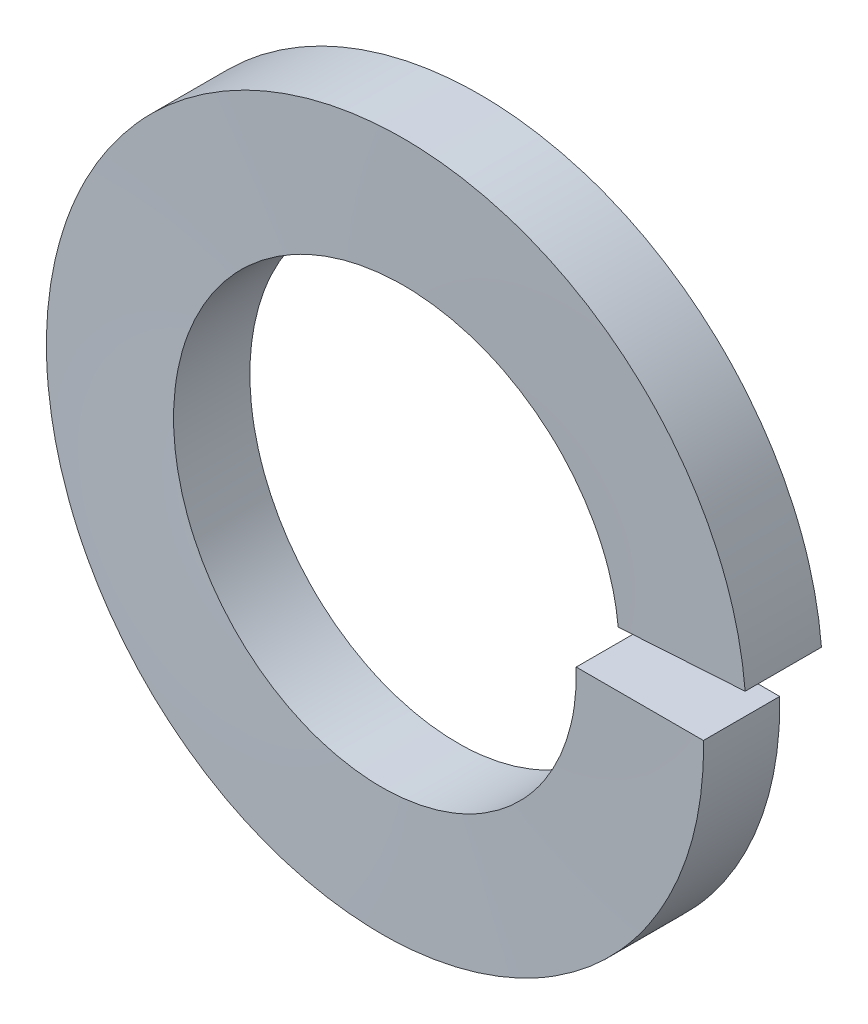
ISO-10303-21;
HEADER;
FILE_DESCRIPTION(('STEP AP214'),'2;1');
FILE_NAME('part.step','',(''),(''),'','','');
FILE_SCHEMA(('AUTOMOTIVE_DESIGN { 1 0 10303 214 1 1 1 1 }'));
ENDSEC;
DATA;
#1=APPLICATION_CONTEXT('core data for automotive mechanical design processes');
#2=APPLICATION_PROTOCOL_DEFINITION('international standard','automotive_design',2000,#1);
#3=PRODUCT_CONTEXT('',#1,'mechanical');
#4=PRODUCT('Part','Part','',(#3));
#5=PRODUCT_RELATED_PRODUCT_CATEGORY('part','',(#4));
#6=PRODUCT_DEFINITION_FORMATION('','',#4);
#7=PRODUCT_DEFINITION_CONTEXT('part definition',#1,'design');
#8=PRODUCT_DEFINITION('design','',#6,#7);
#9=PRODUCT_DEFINITION_SHAPE('','',#8);
#10=(LENGTH_UNIT() NAMED_UNIT(*) SI_UNIT(.MILLI.,.METRE.));
#11=(NAMED_UNIT(*) PLANE_ANGLE_UNIT() SI_UNIT($,.RADIAN.));
#12=(NAMED_UNIT(*) SI_UNIT($,.STERADIAN.) SOLID_ANGLE_UNIT());
#13=UNCERTAINTY_MEASURE_WITH_UNIT(LENGTH_MEASURE(1.E-05),#10,'distance_accuracy_value','');
#14=(GEOMETRIC_REPRESENTATION_CONTEXT(3) GLOBAL_UNCERTAINTY_ASSIGNED_CONTEXT((#13)) GLOBAL_UNIT_ASSIGNED_CONTEXT((#10,
#11,#12)) REPRESENTATION_CONTEXT('',''));
#15=CARTESIAN_POINT('',(0.,0.,0.));
#16=DIRECTION('',(0.,0.,1.));
#17=DIRECTION('',(1.,0.,0.));
#18=AXIS2_PLACEMENT_3D('',#15,#16,#17);
#19=CARTESIAN_POINT('',(4.953907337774,0.6195630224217,-1.78));
#20=CARTESIAN_POINT('',(5.03741687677,-0.04816326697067,-1.801666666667));
#21=CARTESIAN_POINT('',(4.930689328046,-1.417496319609,-1.845));
#22=CARTESIAN_POINT('',(3.975342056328,-3.243136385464,-1.91));
#23=CARTESIAN_POINT('',(2.37878708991,-4.545604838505,-1.975));
#24=CARTESIAN_POINT('',(0.3985506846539,-5.114914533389,-2.04));
#25=CARTESIAN_POINT('',(-1.645970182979,-4.859214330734,-2.105));
#26=CARTESIAN_POINT('',(-3.425005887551,-3.819753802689,-2.17));
#27=CARTESIAN_POINT('',(-4.651609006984,-2.164189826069,-2.235));
#28=CARTESIAN_POINT('',(-5.127935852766,-0.1595552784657,-2.300000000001));
#29=CARTESIAN_POINT('',(-4.777157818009,1.870814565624,-2.365000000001));
#30=CARTESIAN_POINT('',(-3.655853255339,3.599433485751,-2.430000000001));
#31=CARTESIAN_POINT('',(-1.944881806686,4.747485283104,-2.495000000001));
#32=CARTESIAN_POINT('',(0.07978734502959,5.129797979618,-2.560000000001));
#33=CARTESIAN_POINT('',(2.091586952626,4.684700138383,-2.625000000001));
#34=CARTESIAN_POINT('',(3.766027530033,3.484008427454,-2.69));
#35=CARTESIAN_POINT('',(4.833026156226,1.721293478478,-2.755));
#36=CARTESIAN_POINT('',(5.024678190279,0.361244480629,-2.798333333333));
#37=CARTESIAN_POINT('',(4.982842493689,-0.3103819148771,-2.82));
#38=CARTESIAN_POINT('',(5.951138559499,0.744282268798,-1.78));
#39=CARTESIAN_POINT('',(6.051458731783,-0.05785862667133,-1.801666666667));
#40=CARTESIAN_POINT('',(5.92324671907,-1.702841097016,-1.845));
#41=CARTESIAN_POINT('',(4.775586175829,-3.895986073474,-1.91));
#42=CARTESIAN_POINT('',(2.857641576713,-5.460643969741,-1.975));
#43=CARTESIAN_POINT('',(0.4787797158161,-6.144556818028,-2.04));
#44=CARTESIAN_POINT('',(-1.977307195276,-5.837383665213,-2.105));
#45=CARTESIAN_POINT('',(-4.11446626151,-4.58867770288,-2.17));
#46=CARTESIAN_POINT('',(-5.587986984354,-2.599845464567,-2.235));
#47=CARTESIAN_POINT('',(-6.160199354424,-0.191674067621,-2.300000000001));
#48=CARTESIAN_POINT('',(-5.738809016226,2.247413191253,-2.365000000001));
#49=CARTESIAN_POINT('',(-4.391783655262,4.324006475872,-2.430000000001));
#50=CARTESIAN_POINT('',(-2.336390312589,5.703163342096,-2.495000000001));
#51=CARTESIAN_POINT('',(0.09584869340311,6.162436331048,-2.560000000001));
#52=CARTESIAN_POINT('',(2.512627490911,5.627739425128,-2.625000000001));
#53=CARTESIAN_POINT('',(4.524136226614,4.185346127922,-2.69));
#54=CARTESIAN_POINT('',(5.805923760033,2.06779321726,-2.755));
#55=CARTESIAN_POINT('',(6.036155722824,0.4339637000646,-2.798333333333));
#56=CARTESIAN_POINT('',(5.985898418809,-0.3728624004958,-2.82));
#57=CARTESIAN_POINT('',(6.948369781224,0.8690015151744,-1.78));
#58=CARTESIAN_POINT('',(7.065500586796,-0.067553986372,-1.801666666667));
#59=CARTESIAN_POINT('',(6.915804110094,-1.988185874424,-1.845));
#60=CARTESIAN_POINT('',(5.57583029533,-4.548835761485,-1.91));
#61=CARTESIAN_POINT('',(3.336496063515,-6.375683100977,-1.975));
#62=CARTESIAN_POINT('',(0.5590087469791,-7.174199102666,-2.04));
#63=CARTESIAN_POINT('',(-2.308644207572,-6.815552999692,-2.105));
#64=CARTESIAN_POINT('',(-4.803926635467,-5.357601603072,-2.17));
#65=CARTESIAN_POINT('',(-6.524364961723,-3.035501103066,-2.235));
#66=CARTESIAN_POINT('',(-7.192462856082,-0.2237928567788,-2.300000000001));
#67=CARTESIAN_POINT('',(-6.700460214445,2.624011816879,-2.365000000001));
#68=CARTESIAN_POINT('',(-5.127714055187,5.048579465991,-2.430000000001));
#69=CARTESIAN_POINT('',(-2.727898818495,6.658841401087,-2.495000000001));
#70=CARTESIAN_POINT('',(0.1119100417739,7.195074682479,-2.560000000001));
#71=CARTESIAN_POINT('',(2.933668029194,6.570778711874,-2.625000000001));
#72=CARTESIAN_POINT('',(5.282244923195,4.886683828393,-2.69));
#73=CARTESIAN_POINT('',(6.77882136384,2.414292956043,-2.755));
#74=CARTESIAN_POINT('',(7.047633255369,0.5066829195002,-2.798333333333));
#75=CARTESIAN_POINT('',(6.988954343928,-0.4353428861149,-2.82));
#76=CARTESIAN_POINT('',(7.945601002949,0.9937207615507,-1.78));
#77=CARTESIAN_POINT('',(8.079542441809,-0.07724934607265,-1.801666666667));
#78=CARTESIAN_POINT('',(7.908361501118,-2.273530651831,-1.845));
#79=CARTESIAN_POINT('',(6.376074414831,-5.201685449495,-1.91));
#80=CARTESIAN_POINT('',(3.815350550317,-7.290722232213,-1.975));
#81=CARTESIAN_POINT('',(0.6392377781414,-8.203841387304,-2.04));
#82=CARTESIAN_POINT('',(-2.639981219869,-7.793722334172,-2.105));
#83=CARTESIAN_POINT('',(-5.493387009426,-6.126525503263,-2.17));
#84=CARTESIAN_POINT('',(-7.460742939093,-3.471156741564,-2.235));
#85=CARTESIAN_POINT('',(-8.224726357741,-0.2559116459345,-2.300000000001));
#86=CARTESIAN_POINT('',(-7.662111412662,3.000610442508,-2.365000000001));
#87=CARTESIAN_POINT('',(-5.86364445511,5.773152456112,-2.430000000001));
#88=CARTESIAN_POINT('',(-3.119407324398,7.614519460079,-2.495000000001));
#89=CARTESIAN_POINT('',(0.127971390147,8.227713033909,-2.560000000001));
#90=CARTESIAN_POINT('',(3.354708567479,7.51381799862,-2.625000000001));
#91=CARTESIAN_POINT('',(6.040353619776,5.588021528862,-2.69));
#92=CARTESIAN_POINT('',(7.751718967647,2.760792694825,-2.755));
#93=CARTESIAN_POINT('',(8.059110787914,0.5794021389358,-2.798333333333));
#94=CARTESIAN_POINT('',(7.992010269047,-0.4978233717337,-2.82));
#95=B_SPLINE_SURFACE_WITH_KNOTS('',3,3,((#19,#20,#21,#22,#23,#24,#25,#26,#27,#28,#29,#30,#31,
#32,#33,#34,#35,#36,#37),(#38,#39,#40,#41,#42,#43,#44,#45,#46,#47,#48,#49,#50,#51,#52,#53,#54,
#55,#56),(#57,#58,#59,#60,#61,#62,#63,#64,#65,#66,#67,#68,#69,#70,#71,#72,#73,#74,#75),(#76,#77,
#78,#79,#80,#81,#82,#83,#84,#85,#86,#87,#88,#89,#90,#91,#92,#93,#94)),.UNSPECIFIED.,.F.,.F.,.F.,
(4,4),(4,1,1,1,1,1,1,1,1,1,1,1,1,1,1,1,4),(-0.0025,1.0025),(-0.02,0.045,0.11,0.175,0.24,0.305,
0.37,0.435,0.5,0.565,0.63,0.695,0.76,0.825,0.89,0.955,1.02),.UNSPECIFIED.);
#96=CARTESIAN_POINT('',(4.99032798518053,0.310848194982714,-2.80000028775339));
#97=CARTESIAN_POINT('',(4.98218273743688,0.441794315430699,-2.79578266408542));
#98=CARTESIAN_POINT('',(4.96886134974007,0.572416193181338,-2.79156525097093));
#99=CARTESIAN_POINT('',(4.93200013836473,0.832198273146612,-2.78313064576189));
#100=CARTESIAN_POINT('',(4.90846123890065,0.961358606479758,-2.77891345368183));
#101=CARTESIAN_POINT('',(4.85130063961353,1.21741354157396,-2.77047881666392));
#102=CARTESIAN_POINT('',(4.81768010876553,1.34430840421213,-2.76626137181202));
#103=CARTESIAN_POINT('',(4.74056638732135,1.59506634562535,-2.75782576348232));
#104=CARTESIAN_POINT('',(4.69707271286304,1.71892927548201,-2.75360759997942));
#105=CARTESIAN_POINT('',(4.59700208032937,1.97163471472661,-2.74486819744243));
#106=CARTESIAN_POINT('',(4.53970894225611,2.10019429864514,-2.74034698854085));
#107=CARTESIAN_POINT('',(4.41446862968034,2.35207523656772,-2.73130376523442));
#108=CARTESIAN_POINT('',(4.34651726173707,2.47539450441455,-2.72678175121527));
#109=CARTESIAN_POINT('',(4.20049315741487,2.7158108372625,-2.71773979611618));
#110=CARTESIAN_POINT('',(4.12242506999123,2.83291072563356,-2.71321985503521));
#111=CARTESIAN_POINT('',(3.95666822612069,3.06015736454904,-2.70417745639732));
#112=CARTESIAN_POINT('',(3.86897591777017,3.17030152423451,-2.69965499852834));
#113=CARTESIAN_POINT('',(3.68465457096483,3.38276389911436,-2.69061123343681));
#114=CARTESIAN_POINT('',(3.58802904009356,3.48508515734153,-2.68608992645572));
#115=CARTESIAN_POINT('',(3.38646220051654,3.68125783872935,-2.67704646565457));
#116=CARTESIAN_POINT('',(3.28151783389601,3.77510611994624,-2.67252431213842));
#117=CARTESIAN_POINT('',(3.06411875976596,3.95359986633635,-2.66348180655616));
#118=CARTESIAN_POINT('',(2.95166593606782,4.03824762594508,-2.65896145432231));
#119=CARTESIAN_POINT('',(2.7199837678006,4.19779448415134,-2.64991886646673));
#120=CARTESIAN_POINT('',(2.6007519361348,4.272689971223,-2.64539663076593));
#121=CARTESIAN_POINT('',(2.35644771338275,4.41213424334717,-2.63635303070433));
#122=CARTESIAN_POINT('',(2.23137768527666,4.47668716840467,-2.63183166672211));
#123=CARTESIAN_POINT('',(1.97619532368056,4.59504526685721,-2.6227869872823));
#124=CARTESIAN_POINT('',(1.84608114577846,4.64884646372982,-2.61826367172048));
#125=CARTESIAN_POINT('',(1.58183636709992,4.74526773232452,-2.60921992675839));
#126=CARTESIAN_POINT('',(1.44770749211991,4.78789253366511,-2.60469949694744));
#127=CARTESIAN_POINT('',(1.17628489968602,4.86170144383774,-2.59565748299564));
#128=CARTESIAN_POINT('',(1.03899003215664,4.89288132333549,-2.59113589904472));
#129=CARTESIAN_POINT('',(0.762308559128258,4.94354706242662,-2.58209390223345));
#130=CARTESIAN_POINT('',(0.622922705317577,4.96303702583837,-2.57757348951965));
#131=CARTESIAN_POINT('',(0.342955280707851,4.99020765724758,-2.56853009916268));
#132=CARTESIAN_POINT('',(0.202373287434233,4.99788396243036,-2.56400712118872));
#133=CARTESIAN_POINT('',(-0.078897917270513,5.00135370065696,-2.55496247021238));
#134=CARTESIAN_POINT('',(-0.219587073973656,4.99715129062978,-2.55044079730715));
#135=CARTESIAN_POINT('',(-0.50012604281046,4.97691573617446,-2.54139804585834));
#136=CARTESIAN_POINT('',(-0.639975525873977,4.9608782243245,-2.53687696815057));
#137=CARTESIAN_POINT('',(-1.05665411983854,4.89513515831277,-2.52331679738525));
#138=CARTESIAN_POINT('',(-1.3309210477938,4.82780259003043,-2.51427101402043));
#139=CARTESIAN_POINT('',(-1.86409488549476,4.64805479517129,-2.49618085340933));
#140=CARTESIAN_POINT('',(-2.12300188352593,4.53563982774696,-2.48713647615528));
#141=CARTESIAN_POINT('',(-2.61829599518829,4.26890981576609,-2.46905102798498));
#142=CARTESIAN_POINT('',(-2.85468306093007,4.1145946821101,-2.46000995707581));
#143=CARTESIAN_POINT('',(-3.29816728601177,3.7684524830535,-2.44192390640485));
#144=CARTESIAN_POINT('',(-3.50526440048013,3.57662536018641,-2.4328789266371));
#145=CARTESIAN_POINT('',(-3.88429737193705,3.16090956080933,-2.41479157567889));
#146=CARTESIAN_POINT('',(-4.0562332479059,2.93702090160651,-2.40574920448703));
#147=CARTESIAN_POINT('',(-4.36005416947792,2.46354444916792,-2.38766412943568));
#148=CARTESIAN_POINT('',(-4.49193922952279,2.2139566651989,-2.37862142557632));
#149=CARTESIAN_POINT('',(-4.71191192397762,1.69617427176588,-2.36053393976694));
#150=CARTESIAN_POINT('',(-4.79999955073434,1.42797965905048,-2.35148915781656));
#151=CARTESIAN_POINT('',(-4.92987396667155,0.880604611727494,-2.33340350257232));
#152=CARTESIAN_POINT('',(-4.97166075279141,0.6014241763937,-2.32436262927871));
#153=CARTESIAN_POINT('',(-5.00774608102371,0.0400111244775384,-2.30627612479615));
#154=CARTESIAN_POINT('',(-5.00204462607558,-0.242221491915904,-2.2972304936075));
#155=CARTESIAN_POINT('',(-4.94331549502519,-0.801719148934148,-2.2791435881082));
#156=CARTESIAN_POINT('',(-4.89028781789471,-1.07898418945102,-2.27010231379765));
#157=CARTESIAN_POINT('',(-4.73841305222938,-1.62066755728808,-2.25201698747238));
#158=CARTESIAN_POINT('',(-4.63956596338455,-1.88508588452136,-2.24297293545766));
#159=CARTESIAN_POINT('',(-4.39886154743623,-2.39356204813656,-2.2248853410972));
#160=CARTESIAN_POINT('',(-4.25700422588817,-2.63761988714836,-2.2158417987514));
#161=CARTESIAN_POINT('',(-3.93430939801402,-3.09843983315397,-2.19775660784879));
#162=CARTESIAN_POINT('',(-3.75347189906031,-3.31520194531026,-2.18871495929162));
#163=CARTESIAN_POINT('',(-3.35795927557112,-3.71527077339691,-2.17062789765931));
#164=CARTESIAN_POINT('',(-3.14328413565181,-3.89857747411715,-2.16158248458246));
#165=CARTESIAN_POINT('',(-2.68618227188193,-4.22652691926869,-2.14349601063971));
#166=CARTESIAN_POINT('',(-2.44375553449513,-4.371169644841,-2.13445494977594));
#167=CARTESIAN_POINT('',(-1.9380923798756,-4.61767949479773,-2.11636988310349));
#168=CARTESIAN_POINT('',(-1.67485599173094,-4.71954667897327,-2.10732587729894));
#169=CARTESIAN_POINT('',(-1.13485842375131,-4.87761461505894,-2.08923546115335));
#170=CARTESIAN_POINT('',(-0.858097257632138,-4.93381541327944,-2.08018905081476));
#171=CARTESIAN_POINT('',(-0.439105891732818,-4.98267670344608,-2.0666290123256));
#172=CARTESIAN_POINT('',(-0.298723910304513,-4.99305317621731,-2.06210816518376));
#173=CARTESIAN_POINT('',(-0.0175987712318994,-5.00194257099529,-2.05306592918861));
#174=CARTESIAN_POINT('',(0.123144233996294,-5.0004598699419,-2.04854454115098));
#175=CARTESIAN_POINT('',(0.404046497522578,-4.9856339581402,-2.03949996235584));
#176=CARTESIAN_POINT('',(0.544205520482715,-4.97228635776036,-2.03497677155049));
#177=CARTESIAN_POINT('',(0.822850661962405,-4.93383081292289,-2.02593287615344));
#178=CARTESIAN_POINT('',(0.961337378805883,-4.90872721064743,-2.02141217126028));
#179=CARTESIAN_POINT('',(1.23575199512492,-4.84692747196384,-2.01236975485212));
#180=CARTESIAN_POINT('',(1.37167894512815,-4.81022712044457,-2.00784804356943));
#181=CARTESIAN_POINT('',(1.63990569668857,-4.72551395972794,-1.99880600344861));
#182=CARTESIAN_POINT('',(1.77220681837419,-4.67750533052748,-1.99428567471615));
#183=CARTESIAN_POINT('',(2.03234187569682,-4.57048954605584,-1.98524233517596));
#184=CARTESIAN_POINT('',(2.16017410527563,-4.51147824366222,-1.98071932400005));
#185=CARTESIAN_POINT('',(2.41036249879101,-4.38291297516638,-1.97167481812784));
#186=CARTESIAN_POINT('',(2.5327206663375,-4.3133629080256,-1.96715332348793));
#187=CARTESIAN_POINT('',(2.77118342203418,-4.16417219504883,-1.9581096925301));
#188=CARTESIAN_POINT('',(2.88728575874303,-4.08452795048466,-1.95358755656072));
#189=CARTESIAN_POINT('',(3.11232146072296,-3.91576662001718,-1.94454539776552));
#190=CARTESIAN_POINT('',(3.2212574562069,-3.82665304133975,-1.94002537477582));
#191=CARTESIAN_POINT('',(3.43126356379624,-3.6395350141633,-1.9309835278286));
#192=CARTESIAN_POINT('',(3.53233133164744,-3.54152793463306,-1.92646170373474));
#193=CARTESIAN_POINT('',(3.72580987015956,-3.33738086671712,-1.91741877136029));
#194=CARTESIAN_POINT('',(3.81822382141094,-3.23124389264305,-1.91289766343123));
#195=CARTESIAN_POINT('',(3.99382572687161,-3.01150244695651,-1.9038533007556));
#196=CARTESIAN_POINT('',(4.07700880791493,-2.89789408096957,-1.8993300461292));
#197=CARTESIAN_POINT('',(4.23347181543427,-2.6641120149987,-1.89028617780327));
#198=CARTESIAN_POINT('',(4.3067553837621,-2.54394075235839,-1.88576556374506));
#199=CARTESIAN_POINT('',(4.4429859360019,-2.29775593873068,-1.87672111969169));
#200=CARTESIAN_POINT('',(4.5059250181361,-2.1717380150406,-1.87219728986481));
#201=CARTESIAN_POINT('',(4.62092922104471,-1.9148903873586,-1.86315059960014));
#202=CARTESIAN_POINT('',(4.67299835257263,-1.78406247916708,-1.8586277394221));
#203=CARTESIAN_POINT('',(4.76589408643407,-1.51855913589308,-1.84958362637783));
#204=CARTESIAN_POINT('',(4.80672714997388,-1.38388596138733,-1.84506237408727));
#205=CARTESIAN_POINT('',(4.87688891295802,-1.11162599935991,-1.83602187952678));
#206=CARTESIAN_POINT('',(4.90622167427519,-0.974040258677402,-1.83150263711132));
#207=CARTESIAN_POINT('',(4.95310247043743,-0.697404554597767,-1.82248194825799));
#208=CARTESIAN_POINT('',(4.97069409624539,-0.55836197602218,-1.81798049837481));
#209=CARTESIAN_POINT('',(4.99413959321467,-0.279545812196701,-1.80898601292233));
#210=CARTESIAN_POINT('',(5.00001475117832,-0.13977401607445,-1.80449297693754));
#211=CARTESIAN_POINT('',(5.,-9.24892866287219E-09,-1.79999971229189));
#212=B_SPLINE_CURVE_WITH_KNOTS('',3,(#96,#97,#98,#99,#100,#101,#102,#103,#104,#105,#106,#107,
#108,#109,#110,#111,#112,#113,#114,#115,#116,#117,#118,#119,#120,#121,#122,#123,#124,#125,#126,
#127,#128,#129,#130,#131,#132,#133,#134,#135,#136,#137,#138,#139,#140,#141,#142,#143,#144,#145,
#146,#147,#148,#149,#150,#151,#152,#153,#154,#155,#156,#157,#158,#159,#160,#161,#162,#163,#164,
#165,#166,#167,#168,#169,#170,#171,#172,#173,#174,#175,#176,#177,#178,#179,#180,#181,#182,#183,
#184,#185,#186,#187,#188,#189,#190,#191,#192,#193,#194,#195,#196,#197,#198,#199,#200,#201,#202,
#203,#204,#205,#206,#207,#208,#209,#210,#211),.UNSPECIFIED.,.F.,.F.,(4,2,2,2,2,2,2,2,2,2,2,2,2,
2,2,2,2,2,2,2,2,2,2,2,2,2,2,2,2,2,2,2,2,2,2,2,2,2,2,2,2,2,2,2,2,2,2,2,2,2,2,2,2,2,2,2,2,4),(0.,
0.39369622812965,0.787356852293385,1.18097184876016,1.57460613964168,1.99656218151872,
2.41868465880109,2.84061384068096,3.26269926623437,3.68461966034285,4.1066958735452,
4.52866658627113,4.95079312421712,5.37275026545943,5.79486317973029,6.21679717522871,
6.63888693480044,7.06082843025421,7.48292571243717,7.90487530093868,8.32698067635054,
9.17027952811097,10.0135735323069,10.8568693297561,11.700166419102,12.5434630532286,
13.386759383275,14.2300558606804,15.0733523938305,15.9166488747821,16.7599453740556,
17.603241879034,18.4465382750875,19.2898345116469,20.1331311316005,20.9764281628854,
21.8197240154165,22.6630190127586,23.0851210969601,23.5070674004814,23.9291698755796,
24.3511165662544,24.7732168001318,25.1951612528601,25.6172650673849,26.0392130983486,
26.4613119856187,26.8832550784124,27.305323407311,27.7272359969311,28.1493702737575,
28.5713488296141,28.9936482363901,29.4157915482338,29.837691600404,30.259442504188,
30.6796187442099,31.0990308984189),.UNSPECIFIED.);
#213=CARTESIAN_POINT('',(4.99032798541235,0.310848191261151,-2.80000014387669));
#214=VERTEX_POINT('',#213);
#215=CARTESIAN_POINT('',(5.,0.,-1.79999985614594));
#216=VERTEX_POINT('',#215);
#217=EDGE_CURVE('E48',#214,#216,#212,.T.);
#218=DIRECTION('',(1.,0.,0.));
#219=VECTOR('',#218,1.);
#220=CARTESIAN_POINT('',(5.,0.,-1.8));
#221=LINE('',#220,#219);
#222=CARTESIAN_POINT('',(8.,-2.89210768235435E-09,-1.79999985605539));
#223=VERTEX_POINT('',#222);
#224=EDGE_CURVE('E111',#216,#223,#221,.T.);
#225=CARTESIAN_POINT('',(7.98452477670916,0.497357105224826,-2.80000028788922));
#226=CARTESIAN_POINT('',(7.97055778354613,0.721971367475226,-2.79547870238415));
#227=CARTESIAN_POINT('',(7.94706581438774,0.945988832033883,-2.79095734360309));
#228=CARTESIAN_POINT('',(7.88130616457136,1.39124040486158,-2.78191461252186));
#229=CARTESIAN_POINT('',(7.83903938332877,1.61247464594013,-2.77739324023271));
#230=CARTESIAN_POINT('',(7.73603919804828,2.0504377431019,-2.76835276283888));
#231=CARTESIAN_POINT('',(7.67531880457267,2.26716965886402,-2.76383365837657));
#232=CARTESIAN_POINT('',(7.53584112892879,2.69474665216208,-2.75479510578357));
#233=CARTESIAN_POINT('',(7.45708406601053,2.9055918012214,-2.75027565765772));
#234=CARTESIAN_POINT('',(7.28204963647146,3.31999553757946,-2.74123566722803));
#235=CARTESIAN_POINT('',(7.18576414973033,3.52355069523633,-2.73671512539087));
#236=CARTESIAN_POINT('',(6.97638111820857,3.92182648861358,-2.72767466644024));
#237=CARTESIAN_POINT('',(6.86328330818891,4.11654698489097,-2.72315474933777));
#238=CARTESIAN_POINT('',(6.62110568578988,4.4957264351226,-2.71411559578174));
#239=CARTESIAN_POINT('',(6.49202910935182,4.68018745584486,-2.70959635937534));
#240=CARTESIAN_POINT('',(6.21879442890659,5.03757797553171,-2.70055693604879));
#241=CARTESIAN_POINT('',(6.07463639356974,5.21050752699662,-2.69603674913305));
#242=CARTESIAN_POINT('',(5.77228590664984,5.54358155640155,-2.68699682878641));
#243=CARTESIAN_POINT('',(5.6140955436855,5.70372793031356,-2.68247709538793));
#244=CARTESIAN_POINT('',(5.28472950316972,6.01017887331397,-2.67343701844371));
#245=CARTESIAN_POINT('',(5.11354934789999,6.15647862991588,-2.66891667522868));
#246=CARTESIAN_POINT('',(4.75947469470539,6.43412883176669,-2.65987657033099));
#247=CARTESIAN_POINT('',(4.57658053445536,6.56547970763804,-2.65535680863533));
#248=CARTESIAN_POINT('',(4.20037146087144,6.81230462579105,-2.64631676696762));
#249=CARTESIAN_POINT('',(4.00705638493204,6.92777842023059,-2.64179648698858));
#250=CARTESIAN_POINT('',(3.61139583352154,7.14201851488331,-2.63275523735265));
#251=CARTESIAN_POINT('',(3.40905093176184,7.24078587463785,-2.6282342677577));
#252=CARTESIAN_POINT('',(2.99675391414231,7.42092153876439,-2.61919239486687));
#253=CARTESIAN_POINT('',(2.78680163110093,7.50228946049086,-2.61467149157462));
#254=CARTESIAN_POINT('',(2.36084009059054,7.64702685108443,-2.60563177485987));
#255=CARTESIAN_POINT('',(2.14483234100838,7.71040075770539,-2.60111296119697));
#256=CARTESIAN_POINT('',(1.70817024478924,7.81874510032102,-2.59207404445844));
#257=CARTESIAN_POINT('',(1.48751431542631,7.86370915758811,-2.587553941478));
#258=CARTESIAN_POINT('',(1.04323377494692,7.93487666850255,-2.57851383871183));
#259=CARTESIAN_POINT('',(0.819609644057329,7.96108312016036,-2.57399383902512));
#260=CARTESIAN_POINT('',(0.370944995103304,7.99456101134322,-2.56495286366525));
#261=CARTESIAN_POINT('',(0.145904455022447,8.00183215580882,-2.56043188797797));
#262=CARTESIAN_POINT('',(-0.303989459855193,7.99738686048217,-2.55139041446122));
#263=CARTESIAN_POINT('',(-0.528842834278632,7.98567038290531,-2.54686991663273));
#264=CARTESIAN_POINT('',(-0.976767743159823,7.94333262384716,-2.53782971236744));
#265=CARTESIAN_POINT('',(-1.19983923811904,7.91271092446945,-2.53331000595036));
#266=CARTESIAN_POINT('',(-1.64256622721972,7.83278783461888,-2.52427154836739));
#267=CARTESIAN_POINT('',(-1.86222236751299,7.78349002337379,-2.51975279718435));
#268=CARTESIAN_POINT('',(-2.29667596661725,7.66654443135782,-2.51071295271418));
#269=CARTESIAN_POINT('',(-2.51147171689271,7.59889030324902,-2.50619185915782));
#270=CARTESIAN_POINT('',(-2.9345579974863,7.4457353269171,-2.49714978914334));
#271=CARTESIAN_POINT('',(-3.14284973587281,7.36023781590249,-2.49262881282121));
#272=CARTESIAN_POINT('',(-3.55149184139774,7.17199500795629,-2.48358753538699));
#273=CARTESIAN_POINT('',(-3.75184208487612,7.06924944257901,-2.4790672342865));
#274=CARTESIAN_POINT('',(-4.1431695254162,6.8472440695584,-2.4700274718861));
#275=CARTESIAN_POINT('',(-4.33414687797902,6.72798453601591,-2.46550801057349));
#276=CARTESIAN_POINT('',(-4.70537796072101,6.47379529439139,-2.4564688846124));
#277=CARTESIAN_POINT('',(-4.88563145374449,6.33886523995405,-2.45194921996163));
#278=CARTESIAN_POINT('',(-5.2340963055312,6.05432281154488,-2.44290981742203));
#279=CARTESIAN_POINT('',(-5.40230985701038,5.90471312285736,-2.43839007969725));
#280=CARTESIAN_POINT('',(-5.725591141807,5.59180023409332,-2.42934857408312));
#281=CARTESIAN_POINT('',(-5.88065430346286,5.42849231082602,-2.42482680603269));
#282=CARTESIAN_POINT('',(-6.17643953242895,5.08942042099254,-2.41578500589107));
#283=CARTESIAN_POINT('',(-6.31716419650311,4.91365871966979,-2.41126497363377));
#284=CARTESIAN_POINT('',(-6.583305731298,4.55090020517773,-2.40222544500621));
#285=CARTESIAN_POINT('',(-6.70872236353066,4.36390321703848,-2.39770594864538));
#286=CARTESIAN_POINT('',(-6.94335098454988,3.98001033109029,-2.38866675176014));
#287=CARTESIAN_POINT('',(-7.05256328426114,3.7831146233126,-2.3841470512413));
#288=CARTESIAN_POINT('',(-7.25401162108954,3.3808168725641,-2.37510657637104));
#289=CARTESIAN_POINT('',(-7.3462472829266,3.17541464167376,-2.37058580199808));
#290=CARTESIAN_POINT('',(-7.51306802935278,2.75760722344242,-2.36154495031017));
#291=CARTESIAN_POINT('',(-7.58765634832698,2.54520332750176,-2.35702487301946));
#292=CARTESIAN_POINT('',(-7.718696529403,2.1147925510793,-2.34798413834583));
#293=CARTESIAN_POINT('',(-7.77514212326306,1.89678376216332,-2.34346348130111));
#294=CARTESIAN_POINT('',(-7.86945142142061,1.45682516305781,-2.33442342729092));
#295=CARTESIAN_POINT('',(-7.90731852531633,1.23487608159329,-2.32990403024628));
#296=CARTESIAN_POINT('',(-7.96421758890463,0.788571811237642,-2.32086466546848));
#297=CARTESIAN_POINT('',(-7.98324914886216,0.564216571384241,-2.31634469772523));
#298=CARTESIAN_POINT('',(-8.00234025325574,0.114702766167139,-2.30730383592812));
#299=CARTESIAN_POINT('',(-8.00239999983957,-0.110455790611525,-2.30278294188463));
#300=CARTESIAN_POINT('',(-7.98354756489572,-0.559977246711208,-2.29374137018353));
#301=CARTESIAN_POINT('',(-7.96463538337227,-0.784340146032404,-2.28922069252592));
#302=CARTESIAN_POINT('',(-7.90797329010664,-1.23067695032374,-2.28018025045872));
#303=CARTESIAN_POINT('',(-7.87022317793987,-1.45265082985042,-2.27566048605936));
#304=CARTESIAN_POINT('',(-7.77615462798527,-1.89262368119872,-2.2666213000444));
#305=CARTESIAN_POINT('',(-7.71983658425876,-2.11062273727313,-2.26210187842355));
#306=CARTESIAN_POINT('',(-7.58902049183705,-2.54113983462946,-2.2530615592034));
#307=CARTESIAN_POINT('',(-7.51451911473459,-2.75365686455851,-2.24854066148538));
#308=CARTESIAN_POINT('',(-7.34790055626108,-3.17158418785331,-2.23949954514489));
#309=CARTESIAN_POINT('',(-7.25578946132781,-3.37699690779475,-2.23497932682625));
#310=CARTESIAN_POINT('',(-7.05457125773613,-3.77936921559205,-2.2259385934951));
#311=CARTESIAN_POINT('',(-6.9454610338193,-3.97632724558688,-2.22141807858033));
#312=CARTESIAN_POINT('',(-6.7110354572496,-4.36034496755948,-2.21237802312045));
#313=CARTESIAN_POINT('',(-6.58572046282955,-4.54740487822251,-2.20785848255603));
#314=CARTESIAN_POINT('',(-6.31977223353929,-4.91030405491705,-2.19881937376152));
#315=CARTESIAN_POINT('',(-6.17913871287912,-5.08614311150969,-2.19429980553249));
#316=CARTESIAN_POINT('',(-5.88355792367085,-5.42534345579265,-2.18525994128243));
#317=CARTESIAN_POINT('',(-5.72861087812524,-5.58870493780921,-2.18073964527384));
#318=CARTESIAN_POINT('',(-5.40547382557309,-5.90181975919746,-2.17169754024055));
#319=CARTESIAN_POINT('',(-5.23728142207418,-6.05157062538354,-2.16717573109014));
#320=CARTESIAN_POINT('',(-4.88893521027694,-6.33631606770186,-2.15813446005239));
#321=CARTESIAN_POINT('',(-4.70878556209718,-6.47131573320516,-2.15361499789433));
#322=CARTESIAN_POINT('',(-4.33771933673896,-6.72568199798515,-2.14457597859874));
#323=CARTESIAN_POINT('',(-4.14680077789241,-6.8450457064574,-2.14005642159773));
#324=CARTESIAN_POINT('',(-3.75558932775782,-7.06725930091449,-2.1310172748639));
#325=CARTESIAN_POINT('',(-3.55529664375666,-7.17010955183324,-2.126497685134));
#326=CARTESIAN_POINT('',(-3.1467539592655,-7.35856959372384,-2.11745751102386));
#327=CARTESIAN_POINT('',(-2.93850381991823,-7.4441790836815,-2.11293692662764));
#328=CARTESIAN_POINT('',(-2.51553399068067,-7.59754527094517,-2.10389541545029));
#329=CARTESIAN_POINT('',(-2.30081440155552,-7.66530224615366,-2.09937448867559));
#330=CARTESIAN_POINT('',(-1.86639048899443,-7.78249382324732,-2.09033275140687));
#331=CARTESIAN_POINT('',(-1.64668527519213,-7.83192512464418,-2.08581194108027));
#332=CARTESIAN_POINT('',(-1.20396737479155,-7.91208260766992,-2.07677246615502));
#333=CARTESIAN_POINT('',(-0.98095585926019,-7.94281525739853,-2.07225380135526));
#334=CARTESIAN_POINT('',(-0.533094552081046,-7.98538775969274,-2.06321530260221));
#335=CARTESIAN_POINT('',(-0.308244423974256,-7.99722407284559,-2.05869546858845));
#336=CARTESIAN_POINT('',(0.141648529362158,-8.00190858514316,-2.04965492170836));
#337=CARTESIAN_POINT('',(0.366691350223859,-7.99475720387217,-2.04513420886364));
#338=CARTESIAN_POINT('',(0.815378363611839,-7.96151777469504,-2.03609262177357));
#339=CARTESIAN_POINT('',(1.03902252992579,-7.93542937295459,-2.03157174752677));
#340=CARTESIAN_POINT('',(1.48331386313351,-7.86450161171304,-2.02253105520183));
#341=CARTESIAN_POINT('',(1.70396107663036,-7.81966254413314,-2.01801123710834));
#342=CARTESIAN_POINT('',(2.14073172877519,-7.71154272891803,-2.0089711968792));
#343=CARTESIAN_POINT('',(2.35685435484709,-7.64825869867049,-2.00445097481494));
#344=CARTESIAN_POINT('',(2.78292374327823,-7.50372734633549,-1.99541159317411));
#345=CARTESIAN_POINT('',(2.99287261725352,-7.42248624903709,-1.99089243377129));
#346=CARTESIAN_POINT('',(3.40522063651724,-7.24258799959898,-1.98185225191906));
#347=CARTESIAN_POINT('',(3.60761828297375,-7.14392741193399,-1.97733122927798));
#348=CARTESIAN_POINT('',(4.00337613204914,-6.92990518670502,-1.96828954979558));
#349=CARTESIAN_POINT('',(4.19673653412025,-6.81454391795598,-1.96376889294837));
#350=CARTESIAN_POINT('',(4.57304853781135,-6.56793977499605,-1.95472855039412));
#351=CARTESIAN_POINT('',(4.75600019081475,-6.43669697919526,-1.95020886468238));
#352=CARTESIAN_POINT('',(5.11019173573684,-6.15926494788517,-1.94116978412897));
#353=CARTESIAN_POINT('',(5.28143181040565,-6.01307594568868,-1.93665038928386));
#354=CARTESIAN_POINT('',(5.611000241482,-5.70677575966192,-1.92761053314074));
#355=CARTESIAN_POINT('',(5.76932744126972,-5.54666333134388,-1.92309007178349));
#356=CARTESIAN_POINT('',(6.07187439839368,-5.21372416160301,-1.91404988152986));
#357=CARTESIAN_POINT('',(6.21609901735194,-5.04090183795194,-1.90953015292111));
#358=CARTESIAN_POINT('',(6.48953139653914,-4.68365243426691,-1.90048952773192));
#359=CARTESIAN_POINT('',(6.61873325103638,-4.49922083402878,-1.89596863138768));
#360=CARTESIAN_POINT('',(6.86113251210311,-4.12013059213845,-1.88692780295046));
#361=CARTESIAN_POINT('',(6.97433031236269,-3.92547220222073,-1.88240787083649));
#362=CARTESIAN_POINT('',(7.18397024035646,-3.52721358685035,-1.87336583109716));
#363=CARTESIAN_POINT('',(7.28040431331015,-3.32360912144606,-1.86884372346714));
#364=CARTESIAN_POINT('',(7.45576231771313,-2.90899811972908,-1.85979868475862));
#365=CARTESIAN_POINT('',(7.53468655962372,-2.6979917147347,-1.85527575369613));
#366=CARTESIAN_POINT('',(7.67440071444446,-2.27027401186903,-1.84623328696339));
#367=CARTESIAN_POINT('',(7.73520713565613,-2.05356810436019,-1.84171375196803));
#368=CARTESIAN_POINT('',(7.83833183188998,-1.61588472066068,-1.83267707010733));
#369=CARTESIAN_POINT('',(7.88065746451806,-1.39490898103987,-1.82815992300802));
#370=CARTESIAN_POINT('',(7.94237686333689,-0.978358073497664,-1.8196987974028));
#371=CARTESIAN_POINT('',(7.96399558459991,-0.783109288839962,-1.81575466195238));
#372=CARTESIAN_POINT('',(7.99280016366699,-0.391909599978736,-1.80787371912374));
#373=CARTESIAN_POINT('',(8.00001236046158,-0.195960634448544,-1.80393691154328));
#374=CARTESIAN_POINT('',(7.99999999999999,-5.78421764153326E-09,-1.79999971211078));
#375=B_SPLINE_CURVE_WITH_KNOTS('',3,(#225,#226,#227,#228,#229,#230,#231,#232,#233,#234,#235,
#236,#237,#238,#239,#240,#241,#242,#243,#244,#245,#246,#247,#248,#249,#250,#251,#252,#253,#254,
#255,#256,#257,#258,#259,#260,#261,#262,#263,#264,#265,#266,#267,#268,#269,#270,#271,#272,#273,
#274,#275,#276,#277,#278,#279,#280,#281,#282,#283,#284,#285,#286,#287,#288,#289,#290,#291,#292,
#293,#294,#295,#296,#297,#298,#299,#300,#301,#302,#303,#304,#305,#306,#307,#308,#309,#310,#311,
#312,#313,#314,#315,#316,#317,#318,#319,#320,#321,#322,#323,#324,#325,#326,#327,#328,#329,#330,
#331,#332,#333,#334,#335,#336,#337,#338,#339,#340,#341,#342,#343,#344,#345,#346,#347,#348,#349,
#350,#351,#352,#353,#354,#355,#356,#357,#358,#359,#360,#361,#362,#363,#364,#365,#366,#367,#368,
#369,#370,#371,#372,#373,#374),.UNSPECIFIED.,.F.,.F.,(4,2,2,2,2,2,2,2,2,2,2,2,2,2,2,2,2,2,2,2,2,
2,2,2,2,2,2,2,2,2,2,2,2,2,2,2,2,2,2,2,2,2,2,2,2,2,2,2,2,2,2,2,2,2,2,2,2,2,2,2,2,2,2,2,2,2,2,2,2,
2,2,2,2,2,4),(0.,0.675074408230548,1.35011648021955,2.02468371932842,2.69924275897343,
3.37411508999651,4.04899806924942,4.7237445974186,5.39848805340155,6.07313124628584,
6.74800806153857,7.42286543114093,8.09773333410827,8.77255842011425,9.44739834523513,
10.1220716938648,10.7969786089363,11.4717776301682,12.1465871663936,12.8213980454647,
13.4962238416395,14.1709203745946,14.8458505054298,15.5206545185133,16.1954690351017,
16.8702723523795,17.5450905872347,18.2197856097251,18.8947142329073,19.5695204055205,
20.2443370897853,20.9191408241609,21.5939594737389,22.2686543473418,22.9435820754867,
23.6183862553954,24.2932047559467,24.9680160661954,25.6428273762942,26.3176458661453,
26.9924500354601,27.6673778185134,28.3420727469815,29.0168914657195,29.6916952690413,
30.3665116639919,31.0413175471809,31.7162458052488,32.3909404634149,33.0657596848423,
33.7405639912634,34.4153800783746,35.0901856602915,35.7651127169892,36.4398061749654,
37.114625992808,37.7894308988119,38.46424841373,39.1390554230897,39.8139825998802,
40.4886761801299,41.1635029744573,41.8383148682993,42.5131234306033,43.1879214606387,
43.8627798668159,44.5374048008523,45.2122940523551,45.887166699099,46.5623627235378,
47.2375467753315,47.9121137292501,48.5864118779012,49.175335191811,49.7631808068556),.UNSPECIFIED.);
#376=CARTESIAN_POINT('',(7.98452477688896,0.497357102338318,-2.80000014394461));
#377=VERTEX_POINT('',#376);
#378=EDGE_CURVE('E113',#377,#223,#375,.T.);
#379=DIRECTION('',(0.998065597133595,0.0621696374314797,0.));
#380=VECTOR('',#379,1.);
#381=CARTESIAN_POINT('',(4.990327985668,0.3108481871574,-2.8));
#382=LINE('',#381,#380);
#383=EDGE_CURVE('E80',#214,#377,#382,.T.);
#384=ORIENTED_EDGE('',*,*,#217,.T.);
#385=ORIENTED_EDGE('',*,*,#224,.T.);
#386=ORIENTED_EDGE('',*,*,#378,.F.);
#387=ORIENTED_EDGE('',*,*,#383,.F.);
#388=EDGE_LOOP('',(#384,#385,#386,#387));
#389=FACE_BOUND('',#388,.T.);
#390=ADVANCED_FACE('F41',(#389),#95,.T.);
#391=CARTESIAN_POINT('',(4.990327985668,0.3108481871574,-1.));
#392=DIRECTION('',(0.0621696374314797,-0.998065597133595,0.));
#393=DIRECTION('',(0.998065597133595,0.0621696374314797,0.));
#394=AXIS2_PLACEMENT_3D('',#391,#392,#393);
#395=PLANE('',#394);
#396=DIRECTION('',(0.998065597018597,0.0621696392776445,0.));
#397=VECTOR('',#396,1.);
#398=CARTESIAN_POINT('',(6.48709367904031,0.404081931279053,-1.00000028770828));
#399=LINE('',#398,#397);
#400=CARTESIAN_POINT('',(4.99032798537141,0.310848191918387,-1.00000028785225));
#401=VERTEX_POINT('',#400);
#402=CARTESIAN_POINT('',(7.98452477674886,0.497357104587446,-1.00000014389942));
#403=VERTEX_POINT('',#402);
#404=EDGE_CURVE('E105',#401,#403,#399,.T.);
#405=ORIENTED_EDGE('',*,*,#404,.F.);
#406=DIRECTION('',(0.,0.,1.));
#407=VECTOR('',#406,1.);
#408=CARTESIAN_POINT('',(4.990327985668,0.3108481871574,-1.));
#409=LINE('',#408,#407);
#410=EDGE_CURVE('E88',#401,#214,#409,.F.);
#411=ORIENTED_EDGE('',*,*,#410,.T.);
#412=ORIENTED_EDGE('',*,*,#383,.T.);
#413=DIRECTION('',(0.,0.,-1.));
#414=VECTOR('',#413,1.);
#415=CARTESIAN_POINT('',(7.98452477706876,0.497357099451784,0.));
#416=LINE('',#415,#414);
#417=EDGE_CURVE('E150',#403,#377,#416,.T.);
#418=ORIENTED_EDGE('',*,*,#417,.F.);
#419=EDGE_LOOP('',(#405,#411,#412,#418));
#420=FACE_BOUND('',#419,.T.);
#421=ADVANCED_FACE('F142',(#420),#395,.T.);
#422=CARTESIAN_POINT('',(0.,0.,0.));
#423=DIRECTION('',(0.,0.,-1.));
#424=DIRECTION('',(-1.,0.,0.));
#425=AXIS2_PLACEMENT_3D('',#422,#423,#424);
#426=CYLINDRICAL_SURFACE('',#425,8.);
#427=ORIENTED_EDGE('',*,*,#378,.T.);
#428=DIRECTION('',(0.,0.,-1.));
#429=VECTOR('',#428,1.);
#430=CARTESIAN_POINT('',(8.,0.,0.));
#431=LINE('',#430,#429);
#432=CARTESIAN_POINT('',(8.,-2.89208457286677E-09,2.15917052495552E-07));
#433=VERTEX_POINT('',#432);
#434=EDGE_CURVE('E69',#223,#433,#431,.F.);
#435=ORIENTED_EDGE('',*,*,#434,.T.);
#436=CARTESIAN_POINT('',(7.98452477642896,0.497357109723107,-1.00000028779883));
#437=CARTESIAN_POINT('',(7.97055778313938,0.72197137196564,-0.995478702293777));
#438=CARTESIAN_POINT('',(7.9470658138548,0.945988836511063,-0.990957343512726));
#439=CARTESIAN_POINT('',(7.88130616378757,1.39124040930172,-0.981914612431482));
#440=CARTESIAN_POINT('',(7.83903938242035,1.61247465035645,-0.977393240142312));
#441=CARTESIAN_POINT('',(7.73603919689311,2.0504377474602,-0.968352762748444));
#442=CARTESIAN_POINT('',(7.6753188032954,2.2671696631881,-0.963833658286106));
#443=CARTESIAN_POINT('',(7.53584112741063,2.69474665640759,-0.954795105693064));
#444=CARTESIAN_POINT('',(7.45708406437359,2.90559180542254,-0.950275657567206));
#445=CARTESIAN_POINT('',(7.28204963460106,3.31999554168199,-0.941235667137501));
#446=CARTESIAN_POINT('',(7.18576414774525,3.52355069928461,-0.936715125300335));
#447=CARTESIAN_POINT('',(6.97638111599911,3.9218264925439,-0.927674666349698));
#448=CARTESIAN_POINT('',(6.86328330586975,4.11654698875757,-0.923154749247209));
#449=CARTESIAN_POINT('',(6.6211056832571,4.49572643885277,-0.914115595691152));
#450=CARTESIAN_POINT('',(6.49202910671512,4.68018745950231,-0.909596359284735));
#451=CARTESIAN_POINT('',(6.21879442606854,5.03757797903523,-0.900556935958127));
#452=CARTESIAN_POINT('',(6.07463639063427,5.21050753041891,-0.896036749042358));
#453=CARTESIAN_POINT('',(5.77228590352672,5.5435815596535,-0.886996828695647));
#454=CARTESIAN_POINT('',(5.61409554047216,5.7037279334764,-0.882477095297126));
#455=CARTESIAN_POINT('',(5.28472949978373,6.01017887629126,-0.873437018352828));
#456=CARTESIAN_POINT('',(5.11354934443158,6.15647863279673,-0.868916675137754));
#457=CARTESIAN_POINT('',(4.75947469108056,6.43412883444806,-0.85987657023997));
#458=CARTESIAN_POINT('',(4.57658053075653,6.56547971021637,-0.855356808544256));
#459=CARTESIAN_POINT('',(4.20037145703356,6.81230462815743,-0.846316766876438));
#460=CARTESIAN_POINT('',(4.00705638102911,6.92777842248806,-0.841796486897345));
#461=CARTESIAN_POINT('',(3.61139582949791,7.14201851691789,-0.83275523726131));
#462=CARTESIAN_POINT('',(3.40905092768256,7.24078587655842,-0.828234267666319));
#463=CARTESIAN_POINT('',(2.99675390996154,7.42092154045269,-0.819192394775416));
#464=CARTESIAN_POINT('',(2.78680162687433,7.50228946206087,-0.814671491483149));
#465=CARTESIAN_POINT('',(2.36084008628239,7.64702685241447,-0.805631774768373));
#466=CARTESIAN_POINT('',(2.14483233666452,7.71040075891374,-0.801112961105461));
#467=CARTESIAN_POINT('',(1.70817024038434,7.81874510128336,-0.79207404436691));
#468=CARTESIAN_POINT('',(1.48751431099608,7.86370915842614,-0.787553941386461));
#469=CARTESIAN_POINT('',(1.04323377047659,7.93487666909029,-0.778513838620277));
#470=CARTESIAN_POINT('',(0.819609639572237,7.96108312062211,-0.773993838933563));
#471=CARTESIAN_POINT('',(0.37094499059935,7.9945610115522,-0.764952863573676));
#472=CARTESIAN_POINT('',(0.145904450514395,8.00183215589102,-0.760431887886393));
#473=CARTESIAN_POINT('',(-0.303989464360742,7.99738686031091,-0.751390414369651));
#474=CARTESIAN_POINT('',(-0.528842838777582,7.98567038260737,-0.746869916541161));
#475=CARTESIAN_POINT('',(-0.976767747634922,7.94333262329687,-0.737829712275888));
#476=CARTESIAN_POINT('',(-1.19983924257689,7.91271092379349,-0.733310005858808));
#477=CARTESIAN_POINT('',(-1.64256623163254,7.8327878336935,-0.724271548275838));
#478=CARTESIAN_POINT('',(-1.86222237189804,7.78349002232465,-0.719752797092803));
#479=CARTESIAN_POINT('',(-2.29667597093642,7.66654443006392,-0.710712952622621));
#480=CARTESIAN_POINT('',(-2.51147172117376,7.59889030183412,-0.706191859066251));
#481=CARTESIAN_POINT('',(-2.93455800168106,7.44573532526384,-0.69714978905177));
#482=CARTESIAN_POINT('',(-3.1428497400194,7.36023781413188,-0.69262881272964));
#483=CARTESIAN_POINT('',(-3.55149184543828,7.17199500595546,-0.683587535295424));
#484=CARTESIAN_POINT('',(-3.75184208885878,7.06924944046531,-0.679067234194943));
#485=CARTESIAN_POINT('',(-4.14316952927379,6.84724406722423,-0.670027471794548));
#486=CARTESIAN_POINT('',(-4.33414688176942,6.72798453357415,-0.665508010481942));
#487=CARTESIAN_POINT('',(-4.7053779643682,6.47379529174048,-0.65646888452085));
#488=CARTESIAN_POINT('',(-4.88563145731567,6.33886523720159,-0.651949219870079));
#489=CARTESIAN_POINT('',(-5.23409630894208,6.05432280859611,-0.642909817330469));
#490=CARTESIAN_POINT('',(-5.40230986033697,5.90471311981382,-0.638390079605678));
#491=CARTESIAN_POINT('',(-5.7255911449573,5.59180023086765,-0.629348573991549));
#492=CARTESIAN_POINT('',(-5.88065430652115,5.42849230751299,-0.624826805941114));
#493=CARTESIAN_POINT('',(-6.17643953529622,5.08942041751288,-0.615785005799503));
#494=CARTESIAN_POINT('',(-6.31716419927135,4.91365871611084,-0.611264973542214));
#495=CARTESIAN_POINT('',(-6.58330573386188,4.55090020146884,-0.602225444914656));
#496=CARTESIAN_POINT('',(-6.70872236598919,4.36390321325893,-0.597705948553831));
#497=CARTESIAN_POINT('',(-6.94335098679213,3.98001032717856,-0.588666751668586));
#498=CARTESIAN_POINT('',(-7.05256328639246,3.78311461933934,-0.584147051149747));
#499=CARTESIAN_POINT('',(-7.25401162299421,3.38081686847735,-0.57510657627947));
#500=CARTESIAN_POINT('',(-7.34624728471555,3.17541463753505,-0.570585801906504));
#501=CARTESIAN_POINT('',(-7.51306803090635,2.75760721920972,-0.561544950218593));
#502=CARTESIAN_POINT('',(-7.58765634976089,2.54520332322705,-0.557024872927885));
#503=CARTESIAN_POINT('',(-7.71869653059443,2.11479254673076,-0.547984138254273));
#504=CARTESIAN_POINT('',(-7.77514212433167,1.89678375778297,-0.543463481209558));
#505=CARTESIAN_POINT('',(-7.86945142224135,1.45682515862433,-0.534423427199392));
#506=CARTESIAN_POINT('',(-7.90731852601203,1.23487607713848,-0.529904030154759));
#507=CARTESIAN_POINT('',(-7.96421758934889,0.788571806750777,-0.520864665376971));
#508=CARTESIAN_POINT('',(-7.98324914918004,0.564216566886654,-0.51634469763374));
#509=CARTESIAN_POINT('',(-8.00234025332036,0.114702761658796,-0.507303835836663));
#510=CARTESIAN_POINT('',(-8.00239999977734,-0.110455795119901,-0.502782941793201));
#511=CARTESIAN_POINT('',(-7.98354756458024,-0.559977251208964,-0.493741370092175));
#512=CARTESIAN_POINT('',(-7.96463538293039,-0.784340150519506,-0.489220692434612));
#513=CARTESIAN_POINT('',(-7.90797328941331,-1.23067695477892,-0.480180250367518));
#514=CARTESIAN_POINT('',(-7.87022317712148,-1.45265083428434,-0.475660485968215));
#515=CARTESIAN_POINT('',(-7.77615462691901,-1.89262368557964,-0.466621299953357));
#516=CARTESIAN_POINT('',(-7.71983658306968,-2.11062274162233,-0.462101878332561));
#517=CARTESIAN_POINT('',(-7.58902049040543,-2.54113983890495,-0.453061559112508));
#518=CARTESIAN_POINT('',(-7.51451911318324,-2.75365686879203,-0.448540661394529));
#519=CARTESIAN_POINT('',(-7.34790055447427,-3.17158419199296,-0.439499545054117));
#520=CARTESIAN_POINT('',(-7.25578945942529,-3.37699691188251,-0.434979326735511));
#521=CARTESIAN_POINT('',(-7.05457125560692,-3.77936921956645,-0.425938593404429));
#522=CARTESIAN_POINT('',(-6.94546103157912,-3.9763272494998,-0.421418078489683));
#523=CARTESIAN_POINT('',(-6.71103545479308,-4.36034497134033,-0.412378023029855));
#524=CARTESIAN_POINT('',(-6.58572046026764,-4.54740488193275,-0.407858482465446));
#525=CARTESIAN_POINT('',(-6.31977223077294,-4.91030405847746,-0.398819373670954));
#526=CARTESIAN_POINT('',(-6.17913871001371,-5.08614311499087,-0.394299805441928));
#527=CARTESIAN_POINT('',(-5.88355792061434,-5.42534345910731,-0.385259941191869));
#528=CARTESIAN_POINT('',(-5.7286108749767,-5.58870494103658,-0.380739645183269));
#529=CARTESIAN_POINT('',(-5.40547382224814,-5.90181976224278,-0.371697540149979));
#530=CARTESIAN_POINT('',(-5.23728141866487,-6.0515706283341,-0.367175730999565));
#531=CARTESIAN_POINT('',(-4.88893520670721,-6.33631607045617,-0.358134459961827));
#532=CARTESIAN_POINT('',(-4.70878555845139,-6.47131573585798,-0.353614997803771));
#533=CARTESIAN_POINT('',(-4.33771933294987,-6.72568200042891,-0.344575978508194));
#534=CARTESIAN_POINT('',(-4.14680077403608,-6.84504570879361,-0.340056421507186));
#535=CARTESIAN_POINT('',(-3.7555893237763,-7.0672593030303,-0.331017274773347));
#536=CARTESIAN_POINT('',(-3.55529663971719,-7.17010955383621,-0.326497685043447));
#537=CARTESIAN_POINT('',(-3.14675395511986,-7.35856959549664,-0.317457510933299));
#538=CARTESIAN_POINT('',(-2.93850381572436,-7.44417908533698,-0.312936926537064));
#539=CARTESIAN_POINT('',(-2.5155339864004,-7.59754527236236,-0.303895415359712));
#540=CARTESIAN_POINT('',(-2.30081439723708,-7.66530224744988,-0.299374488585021));
#541=CARTESIAN_POINT('',(-1.86639048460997,-7.7824938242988,-0.290332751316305));
#542=CARTESIAN_POINT('',(-1.64668527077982,-7.83192512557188,-0.285811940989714));
#543=CARTESIAN_POINT('',(-1.20396737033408,-7.91208260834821,-0.276772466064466));
#544=CARTESIAN_POINT('',(-0.980955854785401,-7.94281525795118,-0.272253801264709));
#545=CARTESIAN_POINT('',(-0.533094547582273,-7.98538775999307,-0.26321530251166));
#546=CARTESIAN_POINT('',(-0.308244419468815,-7.99722407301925,-0.258695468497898));
#547=CARTESIAN_POINT('',(0.141648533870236,-8.00190858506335,-0.249654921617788));
#548=CARTESIAN_POINT('',(0.366691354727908,-7.99475720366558,-0.245134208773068));
#549=CARTESIAN_POINT('',(0.815378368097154,-7.96151777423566,-0.236092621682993));
#550=CARTESIAN_POINT('',(1.03902253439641,-7.93542937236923,-0.2315717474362));
#551=CARTESIAN_POINT('',(1.48331386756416,-7.86450161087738,-0.222531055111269));
#552=CARTESIAN_POINT('',(1.70396108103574,-7.81966254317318,-0.218011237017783));
#553=CARTESIAN_POINT('',(2.14073173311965,-7.711542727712,-0.208971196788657));
#554=CARTESIAN_POINT('',(2.35685435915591,-7.64825869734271,-0.204450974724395));
#555=CARTESIAN_POINT('',(2.78292374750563,-7.50372734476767,-0.19541159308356));
#556=CARTESIAN_POINT('',(2.99287262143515,-7.42248624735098,-0.19089243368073));
#557=CARTESIAN_POINT('',(3.40522064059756,-7.24258799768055,-0.181852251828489));
#558=CARTESIAN_POINT('',(3.60761828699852,-7.14392740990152,-0.177331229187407));
#559=CARTESIAN_POINT('',(4.00337613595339,-6.92990518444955,-0.168289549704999));
#560=CARTESIAN_POINT('',(4.19673653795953,-6.81454391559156,-0.163768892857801));
#561=CARTESIAN_POINT('',(4.5730485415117,-6.56793977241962,-0.154728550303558));
#562=CARTESIAN_POINT('',(4.75600019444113,-6.43669697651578,-0.150208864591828));
#563=CARTESIAN_POINT('',(5.11019173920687,-6.15926494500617,-0.141169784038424));
#564=CARTESIAN_POINT('',(5.28143181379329,-6.01307594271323,-0.13665038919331));
#565=CARTESIAN_POINT('',(5.61100024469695,-5.70677575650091,-0.127610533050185));
#566=CARTESIAN_POINT('',(5.76932744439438,-5.54666332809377,-0.123090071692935));
#567=CARTESIAN_POINT('',(6.07187440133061,-5.21372415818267,-0.114049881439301));
#568=CARTESIAN_POINT('',(6.21609902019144,-5.04090183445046,-0.109530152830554));
#569=CARTESIAN_POINT('',(6.48953139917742,-4.6836524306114,-0.100489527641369));
#570=CARTESIAN_POINT('',(6.61873325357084,-4.49922083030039,-0.0959686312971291));
#571=CARTESIAN_POINT('',(6.86113251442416,-4.12013058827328,-0.0869278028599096));
#572=CARTESIAN_POINT('',(6.97433031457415,-3.92547219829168,-0.0824078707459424));
#573=CARTESIAN_POINT('',(7.18397024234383,-3.52721358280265,-0.0733658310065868));
#574=CARTESIAN_POINT('',(7.28040431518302,-3.32360911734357,-0.0688437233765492));
#575=CARTESIAN_POINT('',(7.45576231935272,-2.90899811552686,-0.0597986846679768));
#576=CARTESIAN_POINT('',(7.53468656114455,-2.69799171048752,-0.0552757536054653));
#577=CARTESIAN_POINT('',(7.67440071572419,-2.27027400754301,-0.0462332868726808));
#578=CARTESIAN_POINT('',(7.73520713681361,-2.05356810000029,-0.0417137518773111));
#579=CARTESIAN_POINT('',(7.83833183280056,-1.61588471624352,-0.0326770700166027));
#580=CARTESIAN_POINT('',(7.88065746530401,-1.39490897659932,-0.0281599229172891));
#581=CARTESIAN_POINT('',(7.94237686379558,-0.978358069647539,-0.0196987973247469));
#582=CARTESIAN_POINT('',(7.9639955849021,-0.783109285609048,-0.0157546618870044));
#583=CARTESIAN_POINT('',(7.99280016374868,-0.391909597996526,-0.0078737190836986));
#584=CARTESIAN_POINT('',(8.00001236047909,-0.195960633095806,-0.00393691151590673));
#585=CARTESIAN_POINT('',(8.,-5.0614722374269E-09,2.87903924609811E-07));
#586=B_SPLINE_CURVE_WITH_KNOTS('',3,(#436,#437,#438,#439,#440,#441,#442,#443,#444,#445,#446,
#447,#448,#449,#450,#451,#452,#453,#454,#455,#456,#457,#458,#459,#460,#461,#462,#463,#464,#465,
#466,#467,#468,#469,#470,#471,#472,#473,#474,#475,#476,#477,#478,#479,#480,#481,#482,#483,#484,
#485,#486,#487,#488,#489,#490,#491,#492,#493,#494,#495,#496,#497,#498,#499,#500,#501,#502,#503,
#504,#505,#506,#507,#508,#509,#510,#511,#512,#513,#514,#515,#516,#517,#518,#519,#520,#521,#522,
#523,#524,#525,#526,#527,#528,#529,#530,#531,#532,#533,#534,#535,#536,#537,#538,#539,#540,#541,
#542,#543,#544,#545,#546,#547,#548,#549,#550,#551,#552,#553,#554,#555,#556,#557,#558,#559,#560,
#561,#562,#563,#564,#565,#566,#567,#568,#569,#570,#571,#572,#573,#574,#575,#576,#577,#578,#579,
#580,#581,#582,#583,#584,#585),.UNSPECIFIED.,.F.,.F.,(4,2,2,2,2,2,2,2,2,2,2,2,2,2,2,2,2,2,2,2,2,
2,2,2,2,2,2,2,2,2,2,2,2,2,2,2,2,2,2,2,2,2,2,2,2,2,2,2,2,2,2,2,2,2,2,2,2,2,2,2,2,2,2,2,2,2,2,2,2,
2,2,2,2,2,4),(0.,0.67507440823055,1.35011648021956,2.02468371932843,2.69924275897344,
3.37411508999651,4.04899806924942,4.72374459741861,5.39848805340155,6.07313124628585,
6.74800806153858,7.42286543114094,8.09773333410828,8.77255842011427,9.44739834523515,
10.1220716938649,10.7969786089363,11.4717776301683,12.1465871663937,12.8213980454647,
13.4962238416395,14.1709203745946,14.8458505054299,15.5206545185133,16.1954690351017,
16.8702723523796,17.5450905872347,18.2197856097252,18.8947142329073,19.5695204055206,
20.2443370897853,20.9191408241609,21.5939594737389,22.2686543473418,22.9435820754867,
23.6183862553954,24.2932047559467,24.9680160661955,25.6428273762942,26.3176458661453,
26.9924500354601,27.6673778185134,28.3420727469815,29.0168914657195,29.6916952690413,
30.3665116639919,31.0413175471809,31.7162458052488,32.3909404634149,33.0657596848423,
33.7405639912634,34.4153800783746,35.0901856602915,35.7651127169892,36.4398061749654,
37.114625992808,37.7894308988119,38.46424841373,39.1390554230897,39.8139825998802,
40.4886761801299,41.1635029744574,41.8383148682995,42.5131234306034,43.1879214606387,
43.8627798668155,44.5374048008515,45.2122940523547,45.887166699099,46.5623627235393,
47.2375467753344,47.9121137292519,48.5864118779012,49.1753351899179,49.7631808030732),.UNSPECIFIED.);
#587=EDGE_CURVE('E60',#403,#433,#586,.T.);
#588=ORIENTED_EDGE('',*,*,#587,.F.);
#589=ORIENTED_EDGE('',*,*,#417,.T.);
#590=EDGE_LOOP('',(#427,#435,#588,#589));
#591=FACE_BOUND('',#590,.T.);
#592=ADVANCED_FACE('F137',(#591),#426,.T.);
#593=CARTESIAN_POINT('',(5.,0.,0.));
#594=DIRECTION('',(0.,-1.,0.));
#595=DIRECTION('',(0.,0.,-1.));
#596=AXIS2_PLACEMENT_3D('',#593,#594,#595);
#597=PLANE('',#596);
#598=ORIENTED_EDGE('',*,*,#434,.F.);
#599=ORIENTED_EDGE('',*,*,#224,.F.);
#600=DIRECTION('',(0.,0.,-1.));
#601=VECTOR('',#600,1.);
#602=CARTESIAN_POINT('',(5.,0.,0.));
#603=LINE('',#602,#601);
#604=CARTESIAN_POINT('',(5.,0.,2.87840051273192E-07));
#605=VERTEX_POINT('',#604);
#606=EDGE_CURVE('E100',#605,#216,#603,.T.);
#607=ORIENTED_EDGE('',*,*,#606,.F.);
#608=DIRECTION('',(-1.,7.22979849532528E-10,0.));
#609=VECTOR('',#608,1.);
#610=CARTESIAN_POINT('',(6.49966665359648,-4.69945836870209E-09,2.87889403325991E-07));
#611=LINE('',#610,#609);
#612=EDGE_CURVE('E12',#433,#605,#611,.T.);
#613=ORIENTED_EDGE('',*,*,#612,.F.);
#614=EDGE_LOOP('',(#598,#599,#607,#613));
#615=FACE_BOUND('',#614,.T.);
#616=ADVANCED_FACE('F109',(#615),#597,.F.);
#617=CARTESIAN_POINT('',(7.945601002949,0.9937207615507,0.02));
#618=CARTESIAN_POINT('',(8.079542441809,-0.07724934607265,-0.001666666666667));
#619=CARTESIAN_POINT('',(7.908361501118,-2.273530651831,-0.045));
#620=CARTESIAN_POINT('',(6.376074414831,-5.201685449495,-0.11));
#621=CARTESIAN_POINT('',(3.815350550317,-7.290722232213,-0.175));
#622=CARTESIAN_POINT('',(0.6392377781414,-8.203841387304,-0.24));
#623=CARTESIAN_POINT('',(-2.639981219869,-7.793722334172,-0.305));
#624=CARTESIAN_POINT('',(-5.493387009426,-6.126525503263,-0.37));
#625=CARTESIAN_POINT('',(-7.460742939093,-3.471156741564,-0.435));
#626=CARTESIAN_POINT('',(-8.224726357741,-0.2559116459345,-0.5));
#627=CARTESIAN_POINT('',(-7.662111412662,3.000610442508,-0.565));
#628=CARTESIAN_POINT('',(-5.86364445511,5.773152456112,-0.63));
#629=CARTESIAN_POINT('',(-3.119407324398,7.614519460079,-0.695));
#630=CARTESIAN_POINT('',(0.127971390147,8.227713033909,-0.76));
#631=CARTESIAN_POINT('',(3.354708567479,7.51381799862,-0.825));
#632=CARTESIAN_POINT('',(6.040353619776,5.588021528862,-0.89));
#633=CARTESIAN_POINT('',(7.751718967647,2.760792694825,-0.955));
#634=CARTESIAN_POINT('',(8.059110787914,0.5794021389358,-0.9983333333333));
#635=CARTESIAN_POINT('',(7.992010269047,-0.4978233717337,-1.02));
#636=CARTESIAN_POINT('',(6.948369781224,0.8690015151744,0.02));
#637=CARTESIAN_POINT('',(7.065500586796,-0.067553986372,-0.001666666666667));
#638=CARTESIAN_POINT('',(6.915804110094,-1.988185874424,-0.045));
#639=CARTESIAN_POINT('',(5.57583029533,-4.548835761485,-0.11));
#640=CARTESIAN_POINT('',(3.336496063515,-6.375683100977,-0.175));
#641=CARTESIAN_POINT('',(0.5590087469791,-7.174199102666,-0.24));
#642=CARTESIAN_POINT('',(-2.308644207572,-6.815552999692,-0.305));
#643=CARTESIAN_POINT('',(-4.803926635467,-5.357601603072,-0.37));
#644=CARTESIAN_POINT('',(-6.524364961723,-3.035501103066,-0.435));
#645=CARTESIAN_POINT('',(-7.192462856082,-0.2237928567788,-0.5));
#646=CARTESIAN_POINT('',(-6.700460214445,2.624011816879,-0.565));
#647=CARTESIAN_POINT('',(-5.127714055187,5.048579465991,-0.63));
#648=CARTESIAN_POINT('',(-2.727898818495,6.658841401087,-0.695));
#649=CARTESIAN_POINT('',(0.1119100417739,7.195074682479,-0.76));
#650=CARTESIAN_POINT('',(2.933668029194,6.570778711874,-0.825));
#651=CARTESIAN_POINT('',(5.282244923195,4.886683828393,-0.89));
#652=CARTESIAN_POINT('',(6.77882136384,2.414292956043,-0.955));
#653=CARTESIAN_POINT('',(7.047633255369,0.5066829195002,-0.9983333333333));
#654=CARTESIAN_POINT('',(6.988954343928,-0.4353428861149,-1.02));
#655=CARTESIAN_POINT('',(5.951138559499,0.744282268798,0.02));
#656=CARTESIAN_POINT('',(6.051458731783,-0.05785862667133,-0.001666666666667));
#657=CARTESIAN_POINT('',(5.92324671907,-1.702841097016,-0.045));
#658=CARTESIAN_POINT('',(4.775586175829,-3.895986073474,-0.11));
#659=CARTESIAN_POINT('',(2.857641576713,-5.460643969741,-0.175));
#660=CARTESIAN_POINT('',(0.4787797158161,-6.144556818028,-0.24));
#661=CARTESIAN_POINT('',(-1.977307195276,-5.837383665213,-0.305));
#662=CARTESIAN_POINT('',(-4.11446626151,-4.58867770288,-0.37));
#663=CARTESIAN_POINT('',(-5.587986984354,-2.599845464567,-0.435));
#664=CARTESIAN_POINT('',(-6.160199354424,-0.191674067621,-0.5));
#665=CARTESIAN_POINT('',(-5.738809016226,2.247413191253,-0.565));
#666=CARTESIAN_POINT('',(-4.391783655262,4.324006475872,-0.63));
#667=CARTESIAN_POINT('',(-2.336390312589,5.703163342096,-0.695));
#668=CARTESIAN_POINT('',(0.09584869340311,6.162436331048,-0.76));
#669=CARTESIAN_POINT('',(2.512627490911,5.627739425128,-0.825));
#670=CARTESIAN_POINT('',(4.524136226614,4.185346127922,-0.89));
#671=CARTESIAN_POINT('',(5.805923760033,2.06779321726,-0.955));
#672=CARTESIAN_POINT('',(6.036155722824,0.4339637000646,-0.9983333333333));
#673=CARTESIAN_POINT('',(5.985898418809,-0.3728624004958,-1.02));
#674=CARTESIAN_POINT('',(4.953907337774,0.6195630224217,0.02));
#675=CARTESIAN_POINT('',(5.03741687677,-0.04816326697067,-0.001666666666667));
#676=CARTESIAN_POINT('',(4.930689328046,-1.417496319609,-0.045));
#677=CARTESIAN_POINT('',(3.975342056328,-3.243136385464,-0.11));
#678=CARTESIAN_POINT('',(2.37878708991,-4.545604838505,-0.175));
#679=CARTESIAN_POINT('',(0.3985506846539,-5.114914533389,-0.24));
#680=CARTESIAN_POINT('',(-1.645970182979,-4.859214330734,-0.305));
#681=CARTESIAN_POINT('',(-3.425005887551,-3.819753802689,-0.37));
#682=CARTESIAN_POINT('',(-4.651609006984,-2.164189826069,-0.435));
#683=CARTESIAN_POINT('',(-5.127935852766,-0.1595552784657,-0.5));
#684=CARTESIAN_POINT('',(-4.777157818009,1.870814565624,-0.565));
#685=CARTESIAN_POINT('',(-3.655853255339,3.599433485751,-0.63));
#686=CARTESIAN_POINT('',(-1.944881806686,4.747485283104,-0.695));
#687=CARTESIAN_POINT('',(0.07978734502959,5.129797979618,-0.76));
#688=CARTESIAN_POINT('',(2.091586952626,4.684700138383,-0.825));
#689=CARTESIAN_POINT('',(3.766027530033,3.484008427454,-0.89));
#690=CARTESIAN_POINT('',(4.833026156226,1.721293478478,-0.955));
#691=CARTESIAN_POINT('',(5.024678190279,0.361244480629,-0.9983333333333));
#692=CARTESIAN_POINT('',(4.982842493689,-0.3103819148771,-1.02));
#693=B_SPLINE_SURFACE_WITH_KNOTS('',3,3,((#617,#618,#619,#620,#621,#622,#623,#624,#625,#626,
#627,#628,#629,#630,#631,#632,#633,#634,#635),(#636,#637,#638,#639,#640,#641,#642,#643,#644,
#645,#646,#647,#648,#649,#650,#651,#652,#653,#654),(#655,#656,#657,#658,#659,#660,#661,#662,
#663,#664,#665,#666,#667,#668,#669,#670,#671,#672,#673),(#674,#675,#676,#677,#678,#679,#680,
#681,#682,#683,#684,#685,#686,#687,#688,#689,#690,#691,#692)),.UNSPECIFIED.,.F.,.F.,.F.,(4,4),
(4,1,1,1,1,1,1,1,1,1,1,1,1,1,1,1,4),(-0.0025,1.0025),(-0.02,0.045,0.11,0.175,0.24,0.305,0.37,
0.435,0.5,0.565,0.63,0.695,0.76,0.825,0.89,0.955,1.02),.UNSPECIFIED.);
#694=CARTESIAN_POINT('',(5.,-6.68558082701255E-09,2.877906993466E-07));
#695=CARTESIAN_POINT('',(5.00001138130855,-0.131199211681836,-0.00421733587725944));
#696=CARTESIAN_POINT('',(4.99483647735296,-0.262396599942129,-0.00843474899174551));
#697=CARTESIAN_POINT('',(4.97419712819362,-0.523967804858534,-0.016869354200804));
#698=CARTESIAN_POINT('',(4.9587336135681,-0.654341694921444,-0.0210865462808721));
#699=CARTESIAN_POINT('',(4.91760242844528,-0.913454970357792,-0.0295211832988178));
#700=CARTESIAN_POINT('',(4.89193594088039,-1.04219454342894,-0.0337386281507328));
#701=CARTESIAN_POINT('',(4.83056091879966,-1.29726155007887,-0.0421742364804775));
#702=CARTESIAN_POINT('',(4.79485189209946,-1.42358886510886,-0.0463923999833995));
#703=CARTESIAN_POINT('',(4.71068544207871,-1.68202682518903,-0.055131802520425));
#704=CARTESIAN_POINT('',(4.66149563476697,-1.8138996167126,-0.0596530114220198));
#705=CARTESIAN_POINT('',(4.55215693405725,-2.07307946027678,-0.0686962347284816));
#706=CARTESIAN_POINT('',(4.49200372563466,-2.20038469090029,-0.0732182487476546));
#707=CARTESIAN_POINT('',(4.36120868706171,-2.44941422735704,-0.0822602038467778));
#708=CARTESIAN_POINT('',(4.29057167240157,-2.57114106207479,-0.0867801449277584));
#709=CARTESIAN_POINT('',(4.13926331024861,-2.80825315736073,-0.0958225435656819));
#710=CARTESIAN_POINT('',(4.05858825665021,-2.92363605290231,-0.100345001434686));
#711=CARTESIAN_POINT('',(3.88783217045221,-3.1471466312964,-0.109388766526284));
#712=CARTESIAN_POINT('',(3.79775482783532,-3.25527713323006,-0.113910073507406));
#713=CARTESIAN_POINT('',(3.60877388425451,-3.46360167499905,-0.122953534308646));
#714=CARTESIAN_POINT('',(3.50986703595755,-3.56379276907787,-0.127475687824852));
#715=CARTESIAN_POINT('',(3.30398539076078,-3.75545685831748,-0.136518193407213));
#716=CARTESIAN_POINT('',(3.19701261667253,-3.84693202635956,-0.141038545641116));
#717=CARTESIAN_POINT('',(2.97569758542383,-4.0205738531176,-0.150081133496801));
#718=CARTESIAN_POINT('',(2.86135262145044,-4.10273706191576,-0.15460336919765));
#719=CARTESIAN_POINT('',(2.62619018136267,-4.25709989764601,-0.163646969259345));
#720=CARTESIAN_POINT('',(2.50537532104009,-4.32930350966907,-0.168168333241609));
#721=CARTESIAN_POINT('',(2.25804486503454,-4.46329725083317,-0.177213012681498));
#722=CARTESIAN_POINT('',(2.13152718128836,-4.52508352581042,-0.18173632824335));
#723=CARTESIAN_POINT('',(1.87378803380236,-4.63774627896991,-0.190780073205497));
#724=CARTESIAN_POINT('',(1.74256858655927,-4.68862737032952,-0.195300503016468));
#725=CARTESIAN_POINT('',(1.47625970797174,-4.77916774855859,-0.204342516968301));
#726=CARTESIAN_POINT('',(1.34116886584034,-4.81882288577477,-0.208864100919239));
#727=CARTESIAN_POINT('',(1.0681724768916,-4.88659180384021,-0.21790609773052));
#728=CARTESIAN_POINT('',(0.930267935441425,-4.91470963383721,-0.222426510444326));
#729=CARTESIAN_POINT('',(0.652531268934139,-4.9592331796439,-0.231469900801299));
#730=CARTESIAN_POINT('',(0.512698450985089,-4.97563456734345,-0.235992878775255));
#731=CARTESIAN_POINT('',(0.232187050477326,-4.99658412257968,-0.245037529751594));
#732=CARTESIAN_POINT('',(0.0915087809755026,-5.00113643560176,-0.24955920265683));
#733=CARTESIAN_POINT('',(-0.189745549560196,-4.99838103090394,-0.258601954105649));
#734=CARTESIAN_POINT('',(-0.330321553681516,-4.99106893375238,-0.263123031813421));
#735=CARTESIAN_POINT('',(-0.750281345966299,-4.95135779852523,-0.276683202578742));
#736=CARTESIAN_POINT('',(-1.02820377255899,-4.90120655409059,-0.28572898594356));
#737=CARTESIAN_POINT('',(-1.57152109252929,-4.75495368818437,-0.303819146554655));
#738=CARTESIAN_POINT('',(-1.83691605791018,-4.65885233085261,-0.312863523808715));
#739=CARTESIAN_POINT('',(-2.34783457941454,-4.42343053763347,-0.330948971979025));
#740=CARTESIAN_POINT('',(-2.59335809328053,-4.28411000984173,-0.339990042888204));
#741=CARTESIAN_POINT('',(-3.05750397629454,-3.96620864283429,-0.358076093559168));
#742=CARTESIAN_POINT('',(-3.27612630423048,-3.78762774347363,-0.36712107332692));
#743=CARTESIAN_POINT('',(-3.68027097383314,-3.39628044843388,-0.385208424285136));
#744=CARTESIAN_POINT('',(-3.86579333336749,-3.18351407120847,-0.394250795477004));
#745=CARTESIAN_POINT('',(-4.19846240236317,-2.72984194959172,-0.412335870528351));
#746=CARTESIAN_POINT('',(-4.34560912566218,-2.48893621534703,-0.421378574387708));
#747=CARTESIAN_POINT('',(-4.59734664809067,-1.98583104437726,-0.439466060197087));
#748=CARTESIAN_POINT('',(-4.70193743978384,-1.72363160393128,-0.448510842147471));
#749=CARTESIAN_POINT('',(-4.86559073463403,-1.18538964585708,-0.466596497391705));
#750=CARTESIAN_POINT('',(-4.92465323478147,-0.909347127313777,-0.475637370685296));
#751=CARTESIAN_POINT('',(-4.99557160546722,-0.351263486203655,-0.493723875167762));
#752=CARTESIAN_POINT('',(-5.00742747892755,-0.0692223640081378,-0.502769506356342));
#753=CARTESIAN_POINT('',(-4.98359572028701,0.492844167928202,-0.520856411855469));
#754=CARTESIAN_POINT('',(-4.94790808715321,0.772869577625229,-0.52989768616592));
#755=CARTESIAN_POINT('',(-4.83000336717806,1.3229471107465,-0.547983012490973));
#756=CARTESIAN_POINT('',(-4.74778628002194,1.59299923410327,-0.557027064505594));
#757=CARTESIAN_POINT('',(-4.53915926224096,2.11545630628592,-0.57511465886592));
#758=CARTESIAN_POINT('',(-4.4127493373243,2.36786125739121,-0.58415820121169));
#759=CARTESIAN_POINT('',(-4.11932774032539,2.84785161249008,-0.602243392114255));
#760=CARTESIAN_POINT('',(-3.95231607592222,3.07543702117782,-0.611285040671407));
#761=CARTESIAN_POINT('',(-3.5824406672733,3.49932083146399,-0.629372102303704));
#762=CARTESIAN_POINT('',(-3.37957690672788,3.69561921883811,-0.638417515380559));
#763=CARTESIAN_POINT('',(-2.94374776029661,4.05135213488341,-0.656503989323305));
#764=CARTESIAN_POINT('',(-2.71078235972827,4.2107866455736,-0.665545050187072));
#765=CARTESIAN_POINT('',(-2.22142278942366,4.48825654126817,-0.683630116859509));
#766=CARTESIAN_POINT('',(-1.96502865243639,4.60629198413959,-0.692674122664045));
#767=CARTESIAN_POINT('',(-1.43590268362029,4.79762560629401,-0.710764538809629));
#768=CARTESIAN_POINT('',(-1.16317086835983,4.87092383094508,-0.719810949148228));
#769=CARTESIAN_POINT('',(-0.748027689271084,4.94573914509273,-0.733370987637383));
#770=CARTESIAN_POINT('',(-0.608562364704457,4.96482304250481,-0.737891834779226));
#771=CARTESIAN_POINT('',(-0.328533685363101,4.99117268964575,-0.746934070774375));
#772=CARTESIAN_POINT('',(-0.187970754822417,4.99844279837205,-0.751455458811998));
#773=CARTESIAN_POINT('',(0.0933098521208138,5.00110915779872,-0.760500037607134));
#774=CARTESIAN_POINT('',(0.234027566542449,4.99650101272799,-0.765023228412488));
#775=CARTESIAN_POINT('',(0.514524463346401,4.97544312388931,-0.774067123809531));
#776=CARTESIAN_POINT('',(0.654303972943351,4.95899775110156,-0.778587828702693));
#777=CARTESIAN_POINT('',(0.932029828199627,4.91437781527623,-0.787630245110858));
#778=CARTESIAN_POINT('',(1.06997548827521,4.88619898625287,-0.792151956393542));
#779=CARTESIAN_POINT('',(1.34294996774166,4.81832525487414,-0.801193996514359));
#780=CARTESIAN_POINT('',(1.47797984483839,4.77863460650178,-0.805714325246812));
#781=CARTESIAN_POINT('',(1.74426482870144,4.68799833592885,-0.814757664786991));
#782=CARTESIAN_POINT('',(1.87551849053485,4.63704846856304,-0.81928067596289));
#783=CARTESIAN_POINT('',(2.13321577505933,4.52428601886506,-0.828325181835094));
#784=CARTESIAN_POINT('',(2.25966115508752,4.46247745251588,-0.832846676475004));
#785=CARTESIAN_POINT('',(2.50693776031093,4.32840047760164,-0.841890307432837));
#786=CARTESIAN_POINT('',(2.62776696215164,4.25612833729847,-0.846412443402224));
#787=CARTESIAN_POINT('',(2.86285918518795,4.1016838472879,-0.85545460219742));
#788=CARTESIAN_POINT('',(2.97712461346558,4.01951516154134,-0.859974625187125));
#789=CARTESIAN_POINT('',(3.19835754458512,3.84581509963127,-0.869016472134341));
#790=CARTESIAN_POINT('',(3.30532287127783,3.75428095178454,-0.873538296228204));
#791=CARTESIAN_POINT('',(3.51111889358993,3.56255727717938,-0.88258122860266));
#792=CARTESIAN_POINT('',(3.60995257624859,3.46237095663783,-0.887102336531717));
#793=CARTESIAN_POINT('',(3.79887604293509,3.25397168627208,-0.896146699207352));
#794=CARTESIAN_POINT('',(3.88896120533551,3.14575454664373,-0.900669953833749));
#795=CARTESIAN_POINT('',(4.05965569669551,2.92215195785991,-0.90971382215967));
#796=CARTESIAN_POINT('',(4.14026850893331,2.80676916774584,-0.914234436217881));
#797=CARTESIAN_POINT('',(4.29154075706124,2.56952997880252,-0.923278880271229));
#798=CARTESIAN_POINT('',(4.36219257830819,2.44766872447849,-0.927802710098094));
#799=CARTESIAN_POINT('',(4.4929424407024,2.19846771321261,-0.93684940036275));
#800=CARTESIAN_POINT('',(4.55304437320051,2.07112999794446,-0.941372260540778));
#801=CARTESIAN_POINT('',(4.66226665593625,1.81191553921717,-0.950416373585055));
#802=CARTESIAN_POINT('',(4.7113933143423,1.68004145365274,-0.954937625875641));
#803=CARTESIAN_POINT('',(4.79834565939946,1.41267008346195,-0.96397812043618));
#804=CARTESIAN_POINT('',(4.83617533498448,1.27717409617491,-0.968497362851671));
#805=CARTESIAN_POINT('',(4.90016378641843,1.00398807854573,-0.977518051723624));
#806=CARTESIAN_POINT('',(4.92636560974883,0.866308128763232,-0.982019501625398));
#807=CARTESIAN_POINT('',(4.96709965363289,0.589488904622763,-0.991013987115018));
#808=CARTESIAN_POINT('',(4.98165300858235,0.450352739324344,-0.995507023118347));
#809=CARTESIAN_POINT('',(4.99032798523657,0.310848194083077,-1.00000028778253));
#810=B_SPLINE_CURVE_WITH_KNOTS('',3,(#694,#695,#696,#697,#698,#699,#700,#701,#702,#703,#704,
#705,#706,#707,#708,#709,#710,#711,#712,#713,#714,#715,#716,#717,#718,#719,#720,#721,#722,#723,
#724,#725,#726,#727,#728,#729,#730,#731,#732,#733,#734,#735,#736,#737,#738,#739,#740,#741,#742,
#743,#744,#745,#746,#747,#748,#749,#750,#751,#752,#753,#754,#755,#756,#757,#758,#759,#760,#761,
#762,#763,#764,#765,#766,#767,#768,#769,#770,#771,#772,#773,#774,#775,#776,#777,#778,#779,#780,
#781,#782,#783,#784,#785,#786,#787,#788,#789,#790,#791,#792,#793,#794,#795,#796,#797,#798,#799,
#800,#801,#802,#803,#804,#805,#806,#807,#808,#809),.UNSPECIFIED.,.F.,.F.,(4,2,2,2,2,2,2,2,2,2,2,
2,2,2,2,2,2,2,2,2,2,2,2,2,2,2,2,2,2,2,2,2,2,2,2,2,2,2,2,2,2,2,2,2,2,2,2,2,2,2,2,2,2,2,2,2,2,4),
(0.,0.39369622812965,0.787356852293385,1.18097184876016,1.57460613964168,1.99656218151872,
2.41868465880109,2.84061384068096,3.26269926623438,3.68461966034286,4.10669587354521,
4.52866658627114,4.95079312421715,5.37275026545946,5.79486317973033,6.21679717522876,
6.63888693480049,7.06082843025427,7.48292571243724,7.90487530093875,8.32698067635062,
9.17027952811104,10.0135735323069,10.8568693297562,11.7001664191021,12.5434630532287,
13.386759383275,14.2300558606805,15.0733523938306,15.9166488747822,16.7599453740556,
17.6032418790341,18.4465382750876,19.2898345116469,20.1331311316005,20.9764281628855,
21.8197240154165,22.6630190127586,23.0851210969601,23.5070674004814,23.9291698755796,
24.3511165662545,24.7732168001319,25.1951612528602,25.6172650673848,26.0392130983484,
26.4613119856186,26.8832550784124,27.3053234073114,27.7272359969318,28.1493702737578,
28.5713488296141,28.9936482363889,29.4157915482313,29.8376916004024,30.259442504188,
30.6796187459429,31.0990309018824),.UNSPECIFIED.);
#811=EDGE_CURVE('E97',#605,#401,#810,.T.);
#812=ORIENTED_EDGE('',*,*,#587,.T.);
#813=ORIENTED_EDGE('',*,*,#612,.T.);
#814=ORIENTED_EDGE('',*,*,#811,.T.);
#815=ORIENTED_EDGE('',*,*,#404,.T.);
#816=EDGE_LOOP('',(#812,#813,#814,#815));
#817=FACE_BOUND('',#816,.T.);
#818=ADVANCED_FACE('F43',(#817),#693,.T.);
#819=CARTESIAN_POINT('',(0.,0.,2.87840051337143E-07));
#820=DIRECTION('',(0.,0.,-1.));
#821=DIRECTION('',(-1.,0.,0.));
#822=AXIS2_PLACEMENT_3D('',#819,#820,#821);
#823=CYLINDRICAL_SURFACE('',#822,5.);
#824=ORIENTED_EDGE('',*,*,#217,.F.);
#825=ORIENTED_EDGE('',*,*,#410,.F.);
#826=ORIENTED_EDGE('',*,*,#811,.F.);
#827=ORIENTED_EDGE('',*,*,#606,.T.);
#828=EDGE_LOOP('',(#824,#825,#826,#827));
#829=FACE_BOUND('',#828,.T.);
#830=ADVANCED_FACE('F99',(#829),#823,.F.);
#831=CLOSED_SHELL('',(#390,#421,#592,#616,#818,#830));
#832=MANIFOLD_SOLID_BREP('B2',#831);
#833=ADVANCED_BREP_SHAPE_REPRESENTATION('',(#18,#832),#14);
#834=SHAPE_DEFINITION_REPRESENTATION(#9,#833);
ENDSEC;
END-ISO-10303-21;
